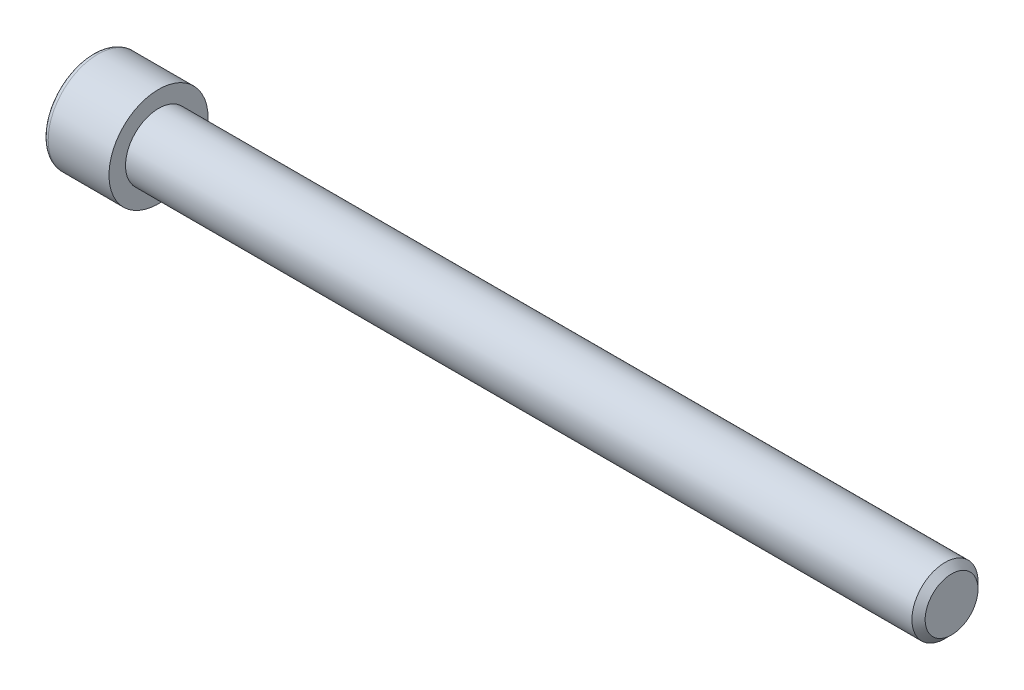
ISO-10303-21;
HEADER;
FILE_DESCRIPTION(('STEP AP214'),'2;1');
FILE_NAME('part.step','',(''),(''),'','','');
FILE_SCHEMA(('AUTOMOTIVE_DESIGN { 1 0 10303 214 1 1 1 1 }'));
ENDSEC;
DATA;
#1=APPLICATION_CONTEXT('core data for automotive mechanical design processes');
#2=APPLICATION_PROTOCOL_DEFINITION('international standard','automotive_design',2000,#1);
#3=PRODUCT_CONTEXT('',#1,'mechanical');
#4=PRODUCT('Part','Part','',(#3));
#5=PRODUCT_RELATED_PRODUCT_CATEGORY('part','',(#4));
#6=PRODUCT_DEFINITION_FORMATION('','',#4);
#7=PRODUCT_DEFINITION_CONTEXT('part definition',#1,'design');
#8=PRODUCT_DEFINITION('design','',#6,#7);
#9=PRODUCT_DEFINITION_SHAPE('','',#8);
#10=(LENGTH_UNIT() NAMED_UNIT(*) SI_UNIT(.MILLI.,.METRE.));
#11=(NAMED_UNIT(*) PLANE_ANGLE_UNIT() SI_UNIT($,.RADIAN.));
#12=(NAMED_UNIT(*) SI_UNIT($,.STERADIAN.) SOLID_ANGLE_UNIT());
#13=UNCERTAINTY_MEASURE_WITH_UNIT(LENGTH_MEASURE(1.E-05),#10,'distance_accuracy_value','');
#14=(GEOMETRIC_REPRESENTATION_CONTEXT(3) GLOBAL_UNCERTAINTY_ASSIGNED_CONTEXT((#13)) GLOBAL_UNIT_ASSIGNED_CONTEXT((#10,
#11,#12)) REPRESENTATION_CONTEXT('',''));
#15=CARTESIAN_POINT('',(0.,0.,0.));
#16=DIRECTION('',(0.,0.,1.));
#17=DIRECTION('',(1.,0.,0.));
#18=AXIS2_PLACEMENT_3D('',#15,#16,#17);
#19=CARTESIAN_POINT('',(0.,4.7625,0.));
#20=DIRECTION('',(-1.,0.,0.));
#21=DIRECTION('',(0.,0.,1.));
#22=AXIS2_PLACEMENT_3D('',#19,#20,#21);
#23=PLANE('',#22);
#24=CARTESIAN_POINT('',(0.,0.,0.));
#25=DIRECTION('',(-1.,0.,0.));
#26=DIRECTION('',(0.,0.,1.));
#27=AXIS2_PLACEMENT_3D('',#24,#25,#26);
#28=CIRCLE('',#27,4.2545);
#29=CARTESIAN_POINT('',(0.,0.,4.2545));
#30=VERTEX_POINT('',#29);
#31=EDGE_CURVE('E149',#30,#30,#28,.T.);
#32=ORIENTED_EDGE('',*,*,#31,.T.);
#33=EDGE_LOOP('',(#32));
#34=FACE_BOUND('',#33,.T.);
#35=DIRECTION('',(0.,-0.866025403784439,0.5));
#36=VECTOR('',#35,1.);
#37=CARTESIAN_POINT('',(0.,0.,-2.7569630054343));
#38=LINE('',#37,#36);
#39=CARTESIAN_POINT('',(0.,0.,-2.7569630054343));
#40=VERTEX_POINT('',#39);
#41=CARTESIAN_POINT('',(0.,-2.3876,-1.37848150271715));
#42=VERTEX_POINT('',#41);
#43=EDGE_CURVE('E48',#40,#42,#38,.T.);
#44=ORIENTED_EDGE('',*,*,#43,.F.);
#45=DIRECTION('',(0.,-0.866025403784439,-0.5));
#46=VECTOR('',#45,1.);
#47=CARTESIAN_POINT('',(0.,2.3876,-1.37848150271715));
#48=LINE('',#47,#46);
#49=CARTESIAN_POINT('',(0.,2.3876,-1.37848150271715));
#50=VERTEX_POINT('',#49);
#51=EDGE_CURVE('E131',#50,#40,#48,.T.);
#52=ORIENTED_EDGE('',*,*,#51,.F.);
#53=DIRECTION('',(0.,0.,-1.));
#54=VECTOR('',#53,1.);
#55=CARTESIAN_POINT('',(0.,2.3876,1.37848150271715));
#56=LINE('',#55,#54);
#57=CARTESIAN_POINT('',(0.,2.3876,1.37848150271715));
#58=VERTEX_POINT('',#57);
#59=EDGE_CURVE('E129',#58,#50,#56,.T.);
#60=ORIENTED_EDGE('',*,*,#59,.F.);
#61=DIRECTION('',(0.,0.866025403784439,-0.5));
#62=VECTOR('',#61,1.);
#63=CARTESIAN_POINT('',(0.,0.,2.7569630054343));
#64=LINE('',#63,#62);
#65=CARTESIAN_POINT('',(0.,0.,2.7569630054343));
#66=VERTEX_POINT('',#65);
#67=EDGE_CURVE('E96',#66,#58,#64,.T.);
#68=ORIENTED_EDGE('',*,*,#67,.F.);
#69=DIRECTION('',(0.,0.866025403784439,0.5));
#70=VECTOR('',#69,1.);
#71=CARTESIAN_POINT('',(0.,-2.3876,1.37848150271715));
#72=LINE('',#71,#70);
#73=CARTESIAN_POINT('',(0.,-2.3876,1.37848150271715));
#74=VERTEX_POINT('',#73);
#75=EDGE_CURVE('E125',#74,#66,#72,.T.);
#76=ORIENTED_EDGE('',*,*,#75,.F.);
#77=DIRECTION('',(0.,0.,1.));
#78=VECTOR('',#77,1.);
#79=CARTESIAN_POINT('',(0.,-2.3876,-1.37848150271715));
#80=LINE('',#79,#78);
#81=EDGE_CURVE('E122',#42,#74,#80,.T.);
#82=ORIENTED_EDGE('',*,*,#81,.F.);
#83=EDGE_LOOP('',(#44,#52,#60,#68,#76,#82));
#84=FACE_BOUND('',#83,.T.);
#85=ADVANCED_FACE('F33',(#34,#84),#23,.T.);
#86=CARTESIAN_POINT('',(82.55,0.,0.));
#87=DIRECTION('',(1.,0.,0.));
#88=DIRECTION('',(0.,0.,-1.));
#89=AXIS2_PLACEMENT_3D('',#86,#87,#88);
#90=PLANE('',#89);
#91=CARTESIAN_POINT('',(82.55,0.,0.));
#92=DIRECTION('',(1.,0.,0.));
#93=DIRECTION('',(0.,0.,-1.));
#94=AXIS2_PLACEMENT_3D('',#91,#92,#93);
#95=CIRCLE('',#94,2.54000000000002);
#96=CARTESIAN_POINT('',(82.55,0.,-2.54000000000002));
#97=VERTEX_POINT('',#96);
#98=EDGE_CURVE('E41',#97,#97,#95,.T.);
#99=ORIENTED_EDGE('',*,*,#98,.T.);
#100=EDGE_LOOP('',(#99));
#101=FACE_BOUND('',#100,.T.);
#102=ADVANCED_FACE('F154',(#101),#90,.T.);
#103=CARTESIAN_POINT('',(0.,0.,0.));
#104=DIRECTION('',(1.,0.,0.));
#105=DIRECTION('',(0.,0.,-1.));
#106=AXIS2_PLACEMENT_3D('',#103,#104,#105);
#107=CYLINDRICAL_SURFACE('',#106,3.17500000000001);
#108=CARTESIAN_POINT('',(81.915,0.,0.));
#109=DIRECTION('',(1.,0.,0.));
#110=DIRECTION('',(0.,0.,-1.));
#111=AXIS2_PLACEMENT_3D('',#108,#109,#110);
#112=CIRCLE('',#111,3.17500000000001);
#113=CARTESIAN_POINT('',(81.915,0.,-3.17500000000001));
#114=VERTEX_POINT('',#113);
#115=EDGE_CURVE('E11',#114,#114,#112,.F.);
#116=ORIENTED_EDGE('',*,*,#115,.T.);
#117=EDGE_LOOP('',(#116));
#118=FACE_BOUND('',#117,.T.);
#119=CARTESIAN_POINT('',(6.35,0.,0.));
#120=DIRECTION('',(1.,0.,0.));
#121=DIRECTION('',(0.,0.,-1.));
#122=AXIS2_PLACEMENT_3D('',#119,#120,#121);
#123=CIRCLE('',#122,3.175);
#124=CARTESIAN_POINT('',(6.35,0.,-3.175));
#125=VERTEX_POINT('',#124);
#126=EDGE_CURVE('E143',#125,#125,#123,.T.);
#127=ORIENTED_EDGE('',*,*,#126,.T.);
#128=EDGE_LOOP('',(#127));
#129=FACE_BOUND('',#128,.T.);
#130=ADVANCED_FACE('F170',(#118,#129),#107,.T.);
#131=CARTESIAN_POINT('',(6.35,3.175,0.));
#132=DIRECTION('',(1.,0.,0.));
#133=DIRECTION('',(0.,0.,-1.));
#134=AXIS2_PLACEMENT_3D('',#131,#132,#133);
#135=PLANE('',#134);
#136=CARTESIAN_POINT('',(6.35,0.,0.));
#137=DIRECTION('',(1.,0.,0.));
#138=DIRECTION('',(0.,0.,-1.));
#139=AXIS2_PLACEMENT_3D('',#136,#137,#138);
#140=CIRCLE('',#139,4.7625);
#141=CARTESIAN_POINT('',(6.35,0.,-4.7625));
#142=VERTEX_POINT('',#141);
#143=EDGE_CURVE('E135',#142,#142,#140,.T.);
#144=ORIENTED_EDGE('',*,*,#143,.T.);
#145=EDGE_LOOP('',(#144));
#146=FACE_BOUND('',#145,.T.);
#147=ORIENTED_EDGE('',*,*,#126,.F.);
#148=EDGE_LOOP('',(#147));
#149=FACE_BOUND('',#148,.T.);
#150=ADVANCED_FACE('F176',(#146,#149),#135,.T.);
#151=CARTESIAN_POINT('',(0.,0.,0.));
#152=DIRECTION('',(1.,0.,0.));
#153=DIRECTION('',(0.,0.,-1.));
#154=AXIS2_PLACEMENT_3D('',#151,#152,#153);
#155=CYLINDRICAL_SURFACE('',#154,4.7625);
#156=CARTESIAN_POINT('',(0.508,0.,0.));
#157=DIRECTION('',(-1.,0.,0.));
#158=DIRECTION('',(0.,0.,1.));
#159=AXIS2_PLACEMENT_3D('',#156,#157,#158);
#160=CIRCLE('',#159,4.7625);
#161=CARTESIAN_POINT('',(0.508,0.,4.7625));
#162=VERTEX_POINT('',#161);
#163=EDGE_CURVE('E146',#162,#162,#160,.F.);
#164=ORIENTED_EDGE('',*,*,#163,.T.);
#165=EDGE_LOOP('',(#164));
#166=FACE_BOUND('',#165,.T.);
#167=ORIENTED_EDGE('',*,*,#143,.F.);
#168=EDGE_LOOP('',(#167));
#169=FACE_BOUND('',#168,.T.);
#170=ADVANCED_FACE('F180',(#166,#169),#155,.T.);
#171=CARTESIAN_POINT('',(3.9624,0.,-2.7569630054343));
#172=DIRECTION('',(0.,-0.5,-0.866025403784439));
#173=DIRECTION('',(0.,0.866025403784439,-0.5));
#174=AXIS2_PLACEMENT_3D('',#171,#172,#173);
#175=PLANE('',#174);
#176=ORIENTED_EDGE('',*,*,#43,.T.);
#177=DIRECTION('',(-1.,0.,0.));
#178=VECTOR('',#177,1.);
#179=CARTESIAN_POINT('',(3.9624,-2.3876,-1.37848150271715));
#180=LINE('',#179,#178);
#181=CARTESIAN_POINT('',(3.9624,-2.3876,-1.37848150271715));
#182=VERTEX_POINT('',#181);
#183=EDGE_CURVE('E78',#182,#42,#180,.T.);
#184=ORIENTED_EDGE('',*,*,#183,.F.);
#185=DIRECTION('',(0.,-0.866025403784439,0.5));
#186=VECTOR('',#185,1.);
#187=CARTESIAN_POINT('',(3.9624,0.,-2.7569630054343));
#188=LINE('',#187,#186);
#189=CARTESIAN_POINT('',(3.9624,0.,-2.7569630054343));
#190=VERTEX_POINT('',#189);
#191=EDGE_CURVE('E133',#190,#182,#188,.T.);
#192=ORIENTED_EDGE('',*,*,#191,.F.);
#193=DIRECTION('',(-1.,0.,0.));
#194=VECTOR('',#193,1.);
#195=CARTESIAN_POINT('',(3.9624,0.,-2.7569630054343));
#196=LINE('',#195,#194);
#197=EDGE_CURVE('E56',#190,#40,#196,.T.);
#198=ORIENTED_EDGE('',*,*,#197,.T.);
#199=EDGE_LOOP('',(#176,#184,#192,#198));
#200=FACE_BOUND('',#199,.T.);
#201=ADVANCED_FACE('F184',(#200),#175,.F.);
#202=CARTESIAN_POINT('',(3.9624,2.3876,-1.37848150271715));
#203=DIRECTION('',(0.,0.5,-0.866025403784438));
#204=DIRECTION('',(0.,0.866025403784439,0.5));
#205=AXIS2_PLACEMENT_3D('',#202,#203,#204);
#206=PLANE('',#205);
#207=ORIENTED_EDGE('',*,*,#51,.T.);
#208=ORIENTED_EDGE('',*,*,#197,.F.);
#209=DIRECTION('',(0.,-0.866025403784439,-0.5));
#210=VECTOR('',#209,1.);
#211=CARTESIAN_POINT('',(3.9624,2.3876,-1.37848150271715));
#212=LINE('',#211,#210);
#213=CARTESIAN_POINT('',(3.9624,2.3876,-1.37848150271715));
#214=VERTEX_POINT('',#213);
#215=EDGE_CURVE('E108',#214,#190,#212,.T.);
#216=ORIENTED_EDGE('',*,*,#215,.F.);
#217=DIRECTION('',(-1.,0.,0.));
#218=VECTOR('',#217,1.);
#219=CARTESIAN_POINT('',(3.9624,2.3876,-1.37848150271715));
#220=LINE('',#219,#218);
#221=EDGE_CURVE('E100',#214,#50,#220,.T.);
#222=ORIENTED_EDGE('',*,*,#221,.T.);
#223=EDGE_LOOP('',(#207,#208,#216,#222));
#224=FACE_BOUND('',#223,.T.);
#225=ADVANCED_FACE('F188',(#224),#206,.F.);
#226=CARTESIAN_POINT('',(3.9624,2.3876,1.37848150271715));
#227=DIRECTION('',(0.,1.,0.));
#228=DIRECTION('',(0.,0.,1.));
#229=AXIS2_PLACEMENT_3D('',#226,#227,#228);
#230=PLANE('',#229);
#231=ORIENTED_EDGE('',*,*,#59,.T.);
#232=ORIENTED_EDGE('',*,*,#221,.F.);
#233=DIRECTION('',(0.,0.,-1.));
#234=VECTOR('',#233,1.);
#235=CARTESIAN_POINT('',(3.9624,2.3876,1.37848150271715));
#236=LINE('',#235,#234);
#237=CARTESIAN_POINT('',(3.9624,2.3876,1.37848150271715));
#238=VERTEX_POINT('',#237);
#239=EDGE_CURVE('E104',#238,#214,#236,.T.);
#240=ORIENTED_EDGE('',*,*,#239,.F.);
#241=DIRECTION('',(-1.,0.,0.));
#242=VECTOR('',#241,1.);
#243=CARTESIAN_POINT('',(3.9624,2.3876,1.37848150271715));
#244=LINE('',#243,#242);
#245=EDGE_CURVE('E89',#238,#58,#244,.T.);
#246=ORIENTED_EDGE('',*,*,#245,.T.);
#247=EDGE_LOOP('',(#231,#232,#240,#246));
#248=FACE_BOUND('',#247,.T.);
#249=ADVANCED_FACE('F105',(#248),#230,.F.);
#250=CARTESIAN_POINT('',(3.9624,0.,2.7569630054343));
#251=DIRECTION('',(0.,0.5,0.866025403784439));
#252=DIRECTION('',(0.,-0.866025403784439,0.5));
#253=AXIS2_PLACEMENT_3D('',#250,#251,#252);
#254=PLANE('',#253);
#255=ORIENTED_EDGE('',*,*,#67,.T.);
#256=ORIENTED_EDGE('',*,*,#245,.F.);
#257=DIRECTION('',(0.,0.866025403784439,-0.5));
#258=VECTOR('',#257,1.);
#259=CARTESIAN_POINT('',(3.9624,0.,2.7569630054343));
#260=LINE('',#259,#258);
#261=CARTESIAN_POINT('',(3.9624,0.,2.7569630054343));
#262=VERTEX_POINT('',#261);
#263=EDGE_CURVE('E93',#262,#238,#260,.T.);
#264=ORIENTED_EDGE('',*,*,#263,.F.);
#265=DIRECTION('',(-1.,0.,0.));
#266=VECTOR('',#265,1.);
#267=CARTESIAN_POINT('',(3.9624,0.,2.7569630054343));
#268=LINE('',#267,#266);
#269=EDGE_CURVE('E101',#262,#66,#268,.T.);
#270=ORIENTED_EDGE('',*,*,#269,.T.);
#271=EDGE_LOOP('',(#255,#256,#264,#270));
#272=FACE_BOUND('',#271,.T.);
#273=ADVANCED_FACE('F91',(#272),#254,.F.);
#274=CARTESIAN_POINT('',(3.9624,-2.3876,1.37848150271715));
#275=DIRECTION('',(0.,-0.5,0.866025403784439));
#276=DIRECTION('',(0.,-0.866025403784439,-0.5));
#277=AXIS2_PLACEMENT_3D('',#274,#275,#276);
#278=PLANE('',#277);
#279=ORIENTED_EDGE('',*,*,#75,.T.);
#280=ORIENTED_EDGE('',*,*,#269,.F.);
#281=DIRECTION('',(0.,0.866025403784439,0.5));
#282=VECTOR('',#281,1.);
#283=CARTESIAN_POINT('',(3.9624,-2.3876,1.37848150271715));
#284=LINE('',#283,#282);
#285=CARTESIAN_POINT('',(3.9624,-2.3876,1.37848150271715));
#286=VERTEX_POINT('',#285);
#287=EDGE_CURVE('E114',#286,#262,#284,.T.);
#288=ORIENTED_EDGE('',*,*,#287,.F.);
#289=DIRECTION('',(-1.,0.,0.));
#290=VECTOR('',#289,1.);
#291=CARTESIAN_POINT('',(3.9624,-2.3876,1.37848150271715));
#292=LINE('',#291,#290);
#293=EDGE_CURVE('E138',#286,#74,#292,.T.);
#294=ORIENTED_EDGE('',*,*,#293,.T.);
#295=EDGE_LOOP('',(#279,#280,#288,#294));
#296=FACE_BOUND('',#295,.T.);
#297=ADVANCED_FACE('F192',(#296),#278,.F.);
#298=CARTESIAN_POINT('',(3.9624,-2.3876,-1.37848150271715));
#299=DIRECTION('',(0.,-1.,0.));
#300=DIRECTION('',(0.,0.,-1.));
#301=AXIS2_PLACEMENT_3D('',#298,#299,#300);
#302=PLANE('',#301);
#303=ORIENTED_EDGE('',*,*,#81,.T.);
#304=ORIENTED_EDGE('',*,*,#293,.F.);
#305=DIRECTION('',(0.,0.,1.));
#306=VECTOR('',#305,1.);
#307=CARTESIAN_POINT('',(3.9624,-2.3876,-1.37848150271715));
#308=LINE('',#307,#306);
#309=EDGE_CURVE('E116',#182,#286,#308,.T.);
#310=ORIENTED_EDGE('',*,*,#309,.F.);
#311=ORIENTED_EDGE('',*,*,#183,.T.);
#312=EDGE_LOOP('',(#303,#304,#310,#311));
#313=FACE_BOUND('',#312,.T.);
#314=ADVANCED_FACE('F189',(#313),#302,.F.);
#315=CARTESIAN_POINT('',(3.9624,0.,0.));
#316=DIRECTION('',(-1.,0.,0.));
#317=DIRECTION('',(0.,0.,1.));
#318=AXIS2_PLACEMENT_3D('',#315,#316,#317);
#319=PLANE('',#318);
#320=ORIENTED_EDGE('',*,*,#191,.T.);
#321=ORIENTED_EDGE('',*,*,#309,.T.);
#322=ORIENTED_EDGE('',*,*,#287,.T.);
#323=ORIENTED_EDGE('',*,*,#263,.T.);
#324=ORIENTED_EDGE('',*,*,#239,.T.);
#325=ORIENTED_EDGE('',*,*,#215,.T.);
#326=EDGE_LOOP('',(#320,#321,#322,#323,#324,#325));
#327=FACE_BOUND('',#326,.T.);
#328=ADVANCED_FACE('F111',(#327),#319,.T.);
#329=CARTESIAN_POINT('',(0.508,0.,0.));
#330=DIRECTION('',(-1.,0.,0.));
#331=DIRECTION('',(0.,0.,1.));
#332=AXIS2_PLACEMENT_3D('',#329,#330,#331);
#333=TOROIDAL_SURFACE('',#332,4.2545,0.508);
#334=ORIENTED_EDGE('',*,*,#31,.F.);
#335=EDGE_LOOP('',(#334));
#336=FACE_BOUND('',#335,.T.);
#337=ORIENTED_EDGE('',*,*,#163,.F.);
#338=EDGE_LOOP('',(#337));
#339=FACE_BOUND('',#338,.T.);
#340=ADVANCED_FACE('F157',(#336,#339),#333,.T.);
#341=CARTESIAN_POINT('',(82.55,0.,0.));
#342=DIRECTION('',(-1.,0.,0.));
#343=DIRECTION('',(0.,0.,1.));
#344=AXIS2_PLACEMENT_3D('',#341,#342,#343);
#345=CONICAL_SURFACE('',#344,2.54000000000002,0.785398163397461);
#346=ORIENTED_EDGE('',*,*,#115,.F.);
#347=EDGE_LOOP('',(#346));
#348=FACE_BOUND('',#347,.T.);
#349=ORIENTED_EDGE('',*,*,#98,.F.);
#350=EDGE_LOOP('',(#349));
#351=FACE_BOUND('',#350,.T.);
#352=ADVANCED_FACE('F35',(#348,#351),#345,.T.);
#353=CLOSED_SHELL('',(#85,#102,#130,#150,#170,#201,#225,#249,#273,#297,#314,#328,#340,#352));
#354=MANIFOLD_SOLID_BREP('B2',#353);
#355=ADVANCED_BREP_SHAPE_REPRESENTATION('',(#18,#354),#14);
#356=SHAPE_DEFINITION_REPRESENTATION(#9,#355);
ENDSEC;
END-ISO-10303-21;
